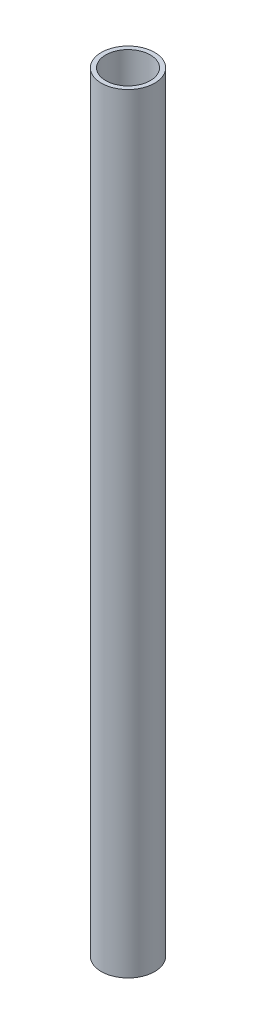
from build123d import *

# Parameters (mm, degrees)
SKETCH1_R           = 3.05
SKETCH1_R_2         = 2.55
EXTRUDE_THIN1_DEPTH = 88


with BuildPart() as part:
    # Sketch1 → Extrude-Thin1 (new body)
    with BuildSketch(Plane(origin=(0, 0, 0), x_dir=(1, 0, 0), z_dir=(0, 1, 0))):
        Circle(SKETCH1_R)
        Circle(SKETCH1_R_2, mode=Mode.SUBTRACT)
    extrude(amount=EXTRUDE_THIN1_DEPTH)


solid = part.part
